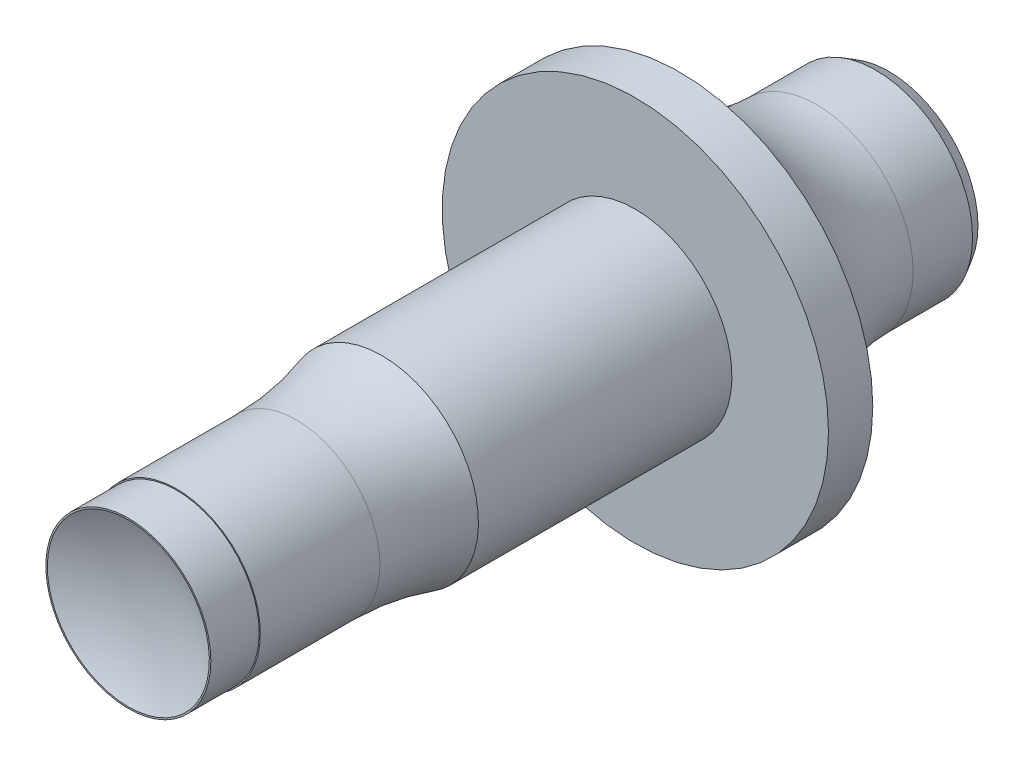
from build123d import *

# Parameters (mm, degrees)
SKETCH1_R           = 12.7
BOSS_EXTRUDE1_DEPTH = 100
SKETCH2_OUTSIDE_W   = 48.652
SKETCH2_OUTSIDE_H   = 48.652
SKETCH2_OUTSIDE_R   = 11
CUT_EXTRUDE1_DEPTH  = 33.333333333
SKETCH3_OUTSIDE_W   = 48.652
SKETCH3_OUTSIDE_H   = 48.652
SKETCH3_OUTSIDE_R   = 10.85
CUT_EXTRUDE2_DEPTH  = 6.35
CHAMFER1_SIZE       = 1.693333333
CHAMFER1_SIZE2      = 0.977646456


with BuildPart() as part:
    # Sketch1 → Boss-Extrude1 (new body)
    with BuildSketch(Plane.XY):
        Circle(SKETCH1_R)
    extrude(amount=-BOSS_EXTRUDE1_DEPTH)

    # Sketch2 outside → Cut-Extrude1 (cut)
    with BuildSketch(Plane.XY):
        Rectangle(SKETCH2_OUTSIDE_W, SKETCH2_OUTSIDE_H)
        Circle(SKETCH2_OUTSIDE_R, mode=Mode.SUBTRACT)
    extrude(amount=-CUT_EXTRUDE1_DEPTH, mode=Mode.SUBTRACT)

    # Sketch3 outside → Cut-Extrude2 (cut)
    with BuildSketch(Plane.XY):
        Rectangle(SKETCH3_OUTSIDE_W, SKETCH3_OUTSIDE_H)
        Circle(SKETCH3_OUTSIDE_R, mode=Mode.SUBTRACT)
    extrude(amount=-CUT_EXTRUDE2_DEPTH, mode=Mode.SUBTRACT)

    # Sketch4 → Cut-Revolve1 (revolve, cut)
    with BuildSketch(Plane(origin=(0, 0, 0), x_dir=(0, 0, -1), z_dir=(1, 0, 0)), mode=Mode.PRIVATE) as cut_revolve1_sk:
        with BuildLine():
            Line((0, 0), (0, 10.65))
            ThreePointArc((0, 10.65), (1.74852458, 5.452080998), (2.340565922, 0))
            Line((2.340565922, 0), (0, 0))
        make_face()
    revolve(cut_revolve1_sk.sketch.rotate(Axis((0, 0, 0), (0, 0, -1)), 180), axis=Axis((0, 0, 0), (0, 0, -1)), mode=Mode.SUBTRACT)

    # Chamfer1
    chamfer1_edges = [part.edges().sort_by_distance(p)[0] for p in [
        (-12.7, 0, -100),
    ]]
    chamfer1_side = [part.faces().sort_by_distance(p)[0] for p in [
        (-12.7, 0, -66.666666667),
    ]]
    chamfer(chamfer1_edges, length=CHAMFER1_SIZE, length2=CHAMFER1_SIZE2, reference=chamfer1_side[0])

    # Sketch5 → Revolve1 (revolve)
    with BuildSketch(Plane(origin=(0, 0, 0), x_dir=(0, 0, -1), z_dir=(1, 0, 0)), mode=Mode.PRIVATE) as revolve1_sk:
        with BuildLine():
            Line((33.333333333, 0), (22.079445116, 0))
            Line((22.079445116, 0), (22.079445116, 11))
            ThreePointArc((22.079445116, 11), (27.770227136, 11.427397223), (33.333333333, 12.7))
            Line((33.333333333, 12.7), (33.333333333, 0))
        make_face()
    revolve(revolve1_sk.sketch.rotate(Axis((0, 0, -33.333333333), (0, 0, 1)), 270), axis=Axis((0, 0, -33.333333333), (0, 0, 1)))

    # Sketch6 → Revolve2 (revolve)
    with BuildSketch(Plane(origin=(0, 0, 0), x_dir=(0, 0, -1), z_dir=(1, 0, 0)), mode=Mode.PRIVATE) as revolve2_sk:
        with BuildLine():
            Line((66.666666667, 0), (90.486666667, 0))
            Line((90.486666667, 0), (90.486666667, 12.7))
            ThreePointArc((90.486666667, 12.7), (79.47371974, 16.194712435), (72.490833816, 25.4))
            Line((72.490833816, 25.4), (66.666666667, 25.4))
            Line((66.666666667, 25.4), (66.666666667, 0))
        make_face()
    revolve(revolve2_sk.sketch.rotate(Axis((0, 0, -66.666666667), (0, 0, -1)), 90), axis=Axis((0, 0, -66.666666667), (0, 0, -1)))


solid = part.part
